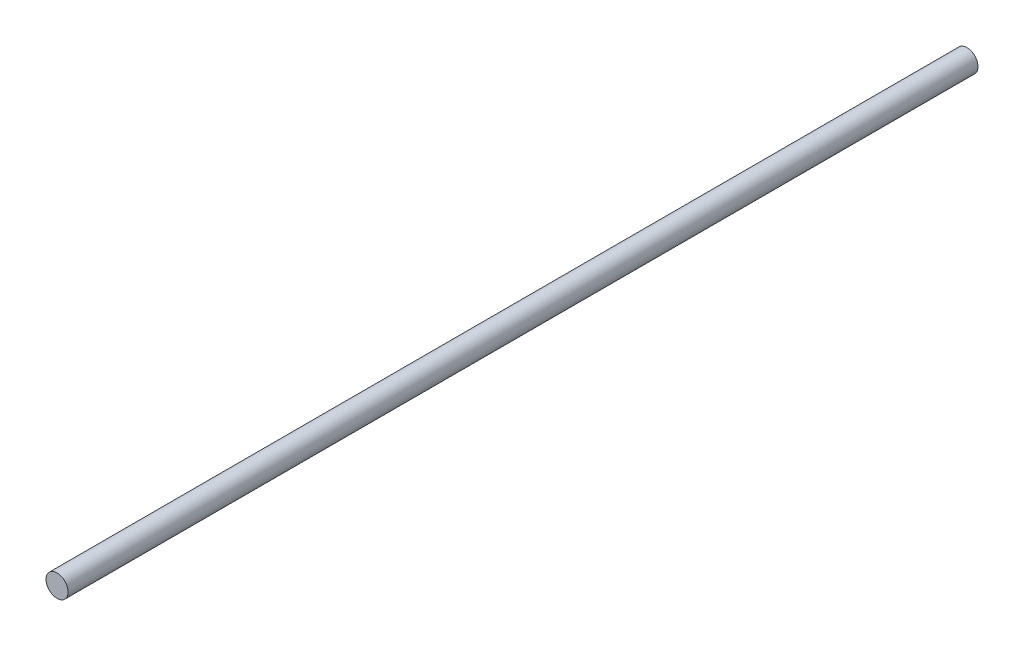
ISO-10303-21;
HEADER;
FILE_DESCRIPTION(('STEP AP214'),'2;1');
FILE_NAME('part.step','',(''),(''),'','','');
FILE_SCHEMA(('AUTOMOTIVE_DESIGN { 1 0 10303 214 1 1 1 1 }'));
ENDSEC;
DATA;
#1=APPLICATION_CONTEXT('core data for automotive mechanical design processes');
#2=APPLICATION_PROTOCOL_DEFINITION('international standard','automotive_design',2000,#1);
#3=PRODUCT_CONTEXT('',#1,'mechanical');
#4=PRODUCT('Part','Part','',(#3));
#5=PRODUCT_RELATED_PRODUCT_CATEGORY('part','',(#4));
#6=PRODUCT_DEFINITION_FORMATION('','',#4);
#7=PRODUCT_DEFINITION_CONTEXT('part definition',#1,'design');
#8=PRODUCT_DEFINITION('design','',#6,#7);
#9=PRODUCT_DEFINITION_SHAPE('','',#8);
#10=(LENGTH_UNIT() NAMED_UNIT(*) SI_UNIT(.MILLI.,.METRE.));
#11=(NAMED_UNIT(*) PLANE_ANGLE_UNIT() SI_UNIT($,.RADIAN.));
#12=(NAMED_UNIT(*) SI_UNIT($,.STERADIAN.) SOLID_ANGLE_UNIT());
#13=UNCERTAINTY_MEASURE_WITH_UNIT(LENGTH_MEASURE(1.E-05),#10,'distance_accuracy_value','');
#14=(GEOMETRIC_REPRESENTATION_CONTEXT(3) GLOBAL_UNCERTAINTY_ASSIGNED_CONTEXT((#13)) GLOBAL_UNIT_ASSIGNED_CONTEXT((#10,
#11,#12)) REPRESENTATION_CONTEXT('',''));
#15=CARTESIAN_POINT('',(0.,0.,0.));
#16=DIRECTION('',(0.,0.,1.));
#17=DIRECTION('',(1.,0.,0.));
#18=AXIS2_PLACEMENT_3D('',#15,#16,#17);
#19=CARTESIAN_POINT('',(0.,0.,1236.));
#20=DIRECTION('',(0.,0.,-1.));
#21=DIRECTION('',(-1.,0.,0.));
#22=AXIS2_PLACEMENT_3D('',#19,#20,#21);
#23=CYLINDRICAL_SURFACE('',#22,15.);
#24=CARTESIAN_POINT('',(0.,0.,1236.));
#25=DIRECTION('',(0.,0.,1.));
#26=DIRECTION('',(1.,0.,0.));
#27=AXIS2_PLACEMENT_3D('',#24,#25,#26);
#28=CIRCLE('',#27,15.);
#29=CARTESIAN_POINT('',(15.,0.,1236.));
#30=VERTEX_POINT('',#29);
#31=EDGE_CURVE('E10',#30,#30,#28,.T.);
#32=ORIENTED_EDGE('',*,*,#31,.F.);
#33=EDGE_LOOP('',(#32));
#34=FACE_BOUND('',#33,.T.);
#35=CARTESIAN_POINT('',(0.,0.,0.));
#36=DIRECTION('',(0.,0.,1.));
#37=DIRECTION('',(1.,0.,0.));
#38=AXIS2_PLACEMENT_3D('',#35,#36,#37);
#39=CIRCLE('',#38,15.);
#40=CARTESIAN_POINT('',(15.,0.,0.));
#41=VERTEX_POINT('',#40);
#42=EDGE_CURVE('E33',#41,#41,#39,.T.);
#43=ORIENTED_EDGE('',*,*,#42,.T.);
#44=EDGE_LOOP('',(#43));
#45=FACE_BOUND('',#44,.T.);
#46=ADVANCED_FACE('F30',(#34,#45),#23,.T.);
#47=CARTESIAN_POINT('',(0.,0.,1236.));
#48=DIRECTION('',(0.,0.,1.));
#49=DIRECTION('',(1.,0.,0.));
#50=AXIS2_PLACEMENT_3D('',#47,#48,#49);
#51=PLANE('',#50);
#52=ORIENTED_EDGE('',*,*,#31,.T.);
#53=EDGE_LOOP('',(#52));
#54=FACE_BOUND('',#53,.T.);
#55=ADVANCED_FACE('F45',(#54),#51,.T.);
#56=CARTESIAN_POINT('',(0.,0.,0.));
#57=DIRECTION('',(0.,0.,1.));
#58=DIRECTION('',(1.,0.,0.));
#59=AXIS2_PLACEMENT_3D('',#56,#57,#58);
#60=PLANE('',#59);
#61=ORIENTED_EDGE('',*,*,#42,.F.);
#62=EDGE_LOOP('',(#61));
#63=FACE_BOUND('',#62,.T.);
#64=ADVANCED_FACE('F43',(#63),#60,.F.);
#65=CLOSED_SHELL('',(#46,#55,#64));
#66=MANIFOLD_SOLID_BREP('B2',#65);
#67=ADVANCED_BREP_SHAPE_REPRESENTATION('',(#18,#66),#14);
#68=SHAPE_DEFINITION_REPRESENTATION(#9,#67);
ENDSEC;
END-ISO-10303-21;
